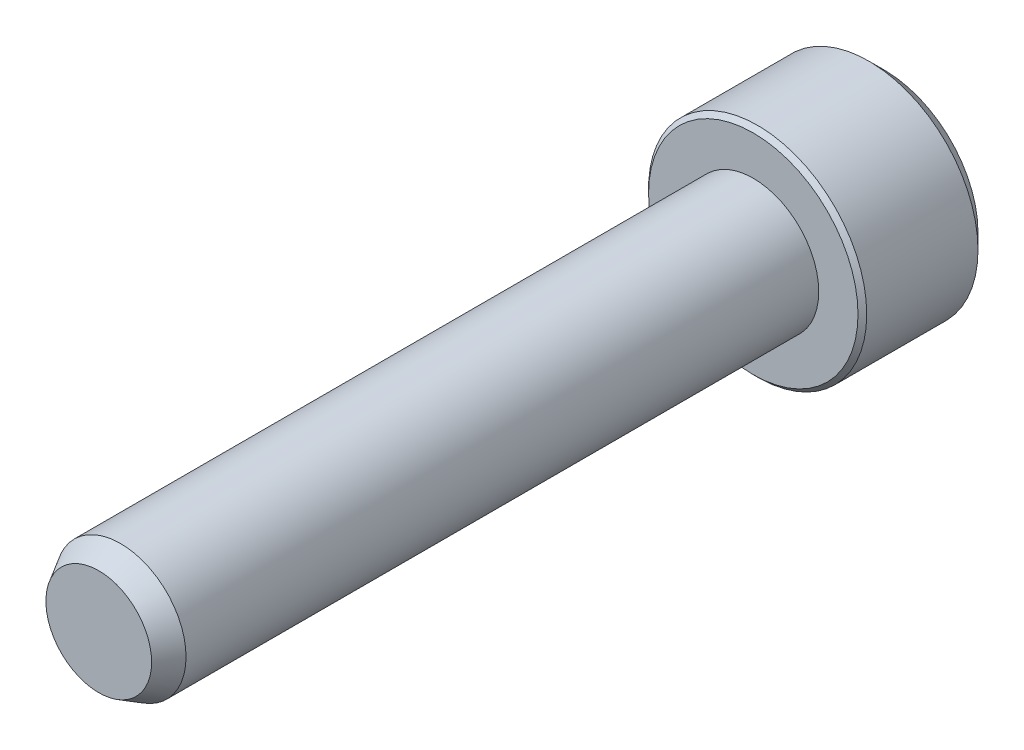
ISO-10303-21;
HEADER;
FILE_DESCRIPTION(('STEP AP214'),'2;1');
FILE_NAME('part.step','',(''),(''),'','','');
FILE_SCHEMA(('AUTOMOTIVE_DESIGN { 1 0 10303 214 1 1 1 1 }'));
ENDSEC;
DATA;
#1=APPLICATION_CONTEXT('core data for automotive mechanical design processes');
#2=APPLICATION_PROTOCOL_DEFINITION('international standard','automotive_design',2000,#1);
#3=PRODUCT_CONTEXT('',#1,'mechanical');
#4=PRODUCT('Part','Part','',(#3));
#5=PRODUCT_RELATED_PRODUCT_CATEGORY('part','',(#4));
#6=PRODUCT_DEFINITION_FORMATION('','',#4);
#7=PRODUCT_DEFINITION_CONTEXT('part definition',#1,'design');
#8=PRODUCT_DEFINITION('design','',#6,#7);
#9=PRODUCT_DEFINITION_SHAPE('','',#8);
#10=(LENGTH_UNIT() NAMED_UNIT(*) SI_UNIT(.MILLI.,.METRE.));
#11=(NAMED_UNIT(*) PLANE_ANGLE_UNIT() SI_UNIT($,.RADIAN.));
#12=(NAMED_UNIT(*) SI_UNIT($,.STERADIAN.) SOLID_ANGLE_UNIT());
#13=UNCERTAINTY_MEASURE_WITH_UNIT(LENGTH_MEASURE(1.E-05),#10,'distance_accuracy_value','');
#14=(GEOMETRIC_REPRESENTATION_CONTEXT(3) GLOBAL_UNCERTAINTY_ASSIGNED_CONTEXT((#13)) GLOBAL_UNIT_ASSIGNED_CONTEXT((#10,
#11,#12)) REPRESENTATION_CONTEXT('',''));
#15=CARTESIAN_POINT('',(0.,0.,0.));
#16=DIRECTION('',(0.,0.,1.));
#17=DIRECTION('',(1.,0.,0.));
#18=AXIS2_PLACEMENT_3D('',#15,#16,#17);
#19=CARTESIAN_POINT('',(0.,3.33066907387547E-13,-6.));
#20=DIRECTION('',(0.,0.,1.));
#21=DIRECTION('',(0.999999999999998,0.,0.));
#22=AXIS2_PLACEMENT_3D('',#19,#20,#21);
#23=PLANE('',#22);
#24=CARTESIAN_POINT('',(0.,3.33066907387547E-13,-6.));
#25=DIRECTION('',(0.,0.,1.));
#26=DIRECTION('',(0.999999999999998,0.,0.));
#27=AXIS2_PLACEMENT_3D('',#24,#25,#26);
#28=CIRCLE('',#27,4.3);
#29=CARTESIAN_POINT('',(4.3,3.33365279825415E-13,-6.));
#30=VERTEX_POINT('',#29);
#31=EDGE_CURVE('E139',#30,#30,#28,.F.);
#32=ORIENTED_EDGE('',*,*,#31,.T.);
#33=EDGE_LOOP('',(#32));
#34=FACE_BOUND('',#33,.T.);
#35=DIRECTION('',(-0.500000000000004,-0.866025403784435,0.));
#36=VECTOR('',#35,1.);
#37=CARTESIAN_POINT('',(-1.44337567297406,2.50000000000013,-6.));
#38=LINE('',#37,#36);
#39=CARTESIAN_POINT('',(-1.44337567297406,2.50000000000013,-6.));
#40=VERTEX_POINT('',#39);
#41=CARTESIAN_POINT('',(-2.88675134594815,1.11022302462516E-13,-6.00000000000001));
#42=VERTEX_POINT('',#41);
#43=EDGE_CURVE('E46',#40,#42,#38,.T.);
#44=ORIENTED_EDGE('',*,*,#43,.T.);
#45=DIRECTION('',(0.500000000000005,-0.866025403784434,0.));
#46=VECTOR('',#45,1.);
#47=CARTESIAN_POINT('',(-2.88675134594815,1.11022302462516E-13,-6.00000000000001));
#48=LINE('',#47,#46);
#49=CARTESIAN_POINT('',(-1.4433756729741,-2.50000000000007,-6.00000000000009));
#50=VERTEX_POINT('',#49);
#51=EDGE_CURVE('E86',#42,#50,#48,.T.);
#52=ORIENTED_EDGE('',*,*,#51,.T.);
#53=DIRECTION('',(0.999999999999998,0.,0.));
#54=VECTOR('',#53,1.);
#55=CARTESIAN_POINT('',(-1.4433756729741,-2.50000000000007,-6.00000000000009));
#56=LINE('',#55,#54);
#57=CARTESIAN_POINT('',(1.44337567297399,-2.49999999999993,-6.00000000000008));
#58=VERTEX_POINT('',#57);
#59=EDGE_CURVE('E94',#50,#58,#56,.T.);
#60=ORIENTED_EDGE('',*,*,#59,.T.);
#61=DIRECTION('',(0.500000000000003,0.866025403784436,0.));
#62=VECTOR('',#61,1.);
#63=CARTESIAN_POINT('',(1.44337567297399,-2.49999999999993,-6.00000000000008));
#64=LINE('',#63,#62);
#65=CARTESIAN_POINT('',(2.88675134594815,0.,-6.));
#66=VERTEX_POINT('',#65);
#67=EDGE_CURVE('E109',#58,#66,#64,.T.);
#68=ORIENTED_EDGE('',*,*,#67,.T.);
#69=DIRECTION('',(-0.499999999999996,0.866025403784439,0.));
#70=VECTOR('',#69,1.);
#71=CARTESIAN_POINT('',(1.443375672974,2.50000000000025,-6.));
#72=LINE('',#71,#70);
#73=CARTESIAN_POINT('',(1.443375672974,2.50000000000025,-6.));
#74=VERTEX_POINT('',#73);
#75=EDGE_CURVE('E112',#66,#74,#72,.T.);
#76=ORIENTED_EDGE('',*,*,#75,.T.);
#77=DIRECTION('',(-0.999999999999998,0.,0.));
#78=VECTOR('',#77,1.);
#79=CARTESIAN_POINT('',(-1.44337567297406,2.50000000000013,-6.));
#80=LINE('',#79,#78);
#81=EDGE_CURVE('E105',#74,#40,#80,.T.);
#82=ORIENTED_EDGE('',*,*,#81,.T.);
#83=EDGE_LOOP('',(#44,#52,#60,#68,#76,#82));
#84=FACE_BOUND('',#83,.T.);
#85=ADVANCED_FACE('F31',(#34,#84),#23,.F.);
#86=CARTESIAN_POINT('',(0.,0.,29.9999999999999));
#87=DIRECTION('',(0.,0.,-1.));
#88=DIRECTION('',(-0.999999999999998,0.,0.));
#89=AXIS2_PLACEMENT_3D('',#86,#87,#88);
#90=CYLINDRICAL_SURFACE('',#89,3.);
#91=CARTESIAN_POINT('',(0.,0.,28.9999999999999));
#92=DIRECTION('',(0.,0.,1.));
#93=DIRECTION('',(0.999999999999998,0.,0.));
#94=AXIS2_PLACEMENT_3D('',#91,#92,#93);
#95=CIRCLE('',#94,3.);
#96=CARTESIAN_POINT('',(2.99999999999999,0.,28.9999999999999));
#97=VERTEX_POINT('',#96);
#98=EDGE_CURVE('E145',#97,#97,#95,.F.);
#99=ORIENTED_EDGE('',*,*,#98,.T.);
#100=EDGE_LOOP('',(#99));
#101=FACE_BOUND('',#100,.T.);
#102=CARTESIAN_POINT('',(0.,0.,0.));
#103=DIRECTION('',(0.,0.,1.));
#104=DIRECTION('',(0.999999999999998,0.,0.));
#105=AXIS2_PLACEMENT_3D('',#102,#103,#104);
#106=CIRCLE('',#105,3.);
#107=CARTESIAN_POINT('',(2.99999999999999,0.,0.));
#108=VERTEX_POINT('',#107);
#109=EDGE_CURVE('E100',#108,#108,#106,.T.);
#110=ORIENTED_EDGE('',*,*,#109,.T.);
#111=EDGE_LOOP('',(#110));
#112=FACE_BOUND('',#111,.T.);
#113=ADVANCED_FACE('F33',(#101,#112),#90,.T.);
#114=CARTESIAN_POINT('',(0.,0.,29.9999999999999));
#115=DIRECTION('',(0.,0.,1.));
#116=DIRECTION('',(0.999999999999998,0.,0.));
#117=AXIS2_PLACEMENT_3D('',#114,#115,#116);
#118=PLANE('',#117);
#119=CARTESIAN_POINT('',(0.,0.,29.9999999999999));
#120=DIRECTION('',(0.,0.,1.));
#121=DIRECTION('',(0.999999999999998,0.,0.));
#122=AXIS2_PLACEMENT_3D('',#119,#120,#121);
#123=CIRCLE('',#122,2.42264973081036);
#124=CARTESIAN_POINT('',(2.42264973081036,0.,29.9999999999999));
#125=VERTEX_POINT('',#124);
#126=EDGE_CURVE('E142',#125,#125,#123,.T.);
#127=ORIENTED_EDGE('',*,*,#126,.T.);
#128=EDGE_LOOP('',(#127));
#129=FACE_BOUND('',#128,.T.);
#130=ADVANCED_FACE('F171',(#129),#118,.T.);
#131=CARTESIAN_POINT('',(0.,0.,0.));
#132=DIRECTION('',(0.,0.,1.));
#133=DIRECTION('',(0.999999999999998,0.,0.));
#134=AXIS2_PLACEMENT_3D('',#131,#132,#133);
#135=PLANE('',#134);
#136=CARTESIAN_POINT('',(0.,0.,0.));
#137=DIRECTION('',(0.,0.,1.));
#138=DIRECTION('',(0.999999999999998,0.,0.));
#139=AXIS2_PLACEMENT_3D('',#136,#137,#138);
#140=CIRCLE('',#139,4.8);
#141=CARTESIAN_POINT('',(4.79999999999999,0.,0.));
#142=VERTEX_POINT('',#141);
#143=EDGE_CURVE('E39',#142,#142,#140,.T.);
#144=ORIENTED_EDGE('',*,*,#143,.T.);
#145=EDGE_LOOP('',(#144));
#146=FACE_BOUND('',#145,.T.);
#147=ORIENTED_EDGE('',*,*,#109,.F.);
#148=EDGE_LOOP('',(#147));
#149=FACE_BOUND('',#148,.T.);
#150=ADVANCED_FACE('F150',(#146,#149),#135,.T.);
#151=CARTESIAN_POINT('',(0.,3.33066907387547E-13,-6.));
#152=DIRECTION('',(0.,0.,1.));
#153=DIRECTION('',(0.999999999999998,0.,0.));
#154=AXIS2_PLACEMENT_3D('',#151,#152,#153);
#155=CYLINDRICAL_SURFACE('',#154,5.);
#156=CARTESIAN_POINT('',(0.,0.,-0.199999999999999));
#157=DIRECTION('',(0.,0.,1.));
#158=DIRECTION('',(0.999999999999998,0.,0.));
#159=AXIS2_PLACEMENT_3D('',#156,#157,#158);
#160=CIRCLE('',#159,5.);
#161=CARTESIAN_POINT('',(5.,0.,-0.199999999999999));
#162=VERTEX_POINT('',#161);
#163=EDGE_CURVE('E11',#162,#162,#160,.F.);
#164=ORIENTED_EDGE('',*,*,#163,.T.);
#165=EDGE_LOOP('',(#164));
#166=FACE_BOUND('',#165,.T.);
#167=CARTESIAN_POINT('',(0.,2.63677968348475E-13,-5.3));
#168=DIRECTION('',(0.,0.,1.));
#169=DIRECTION('',(0.999999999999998,0.,0.));
#170=AXIS2_PLACEMENT_3D('',#167,#168,#169);
#171=CIRCLE('',#170,5.);
#172=CARTESIAN_POINT('',(5.00000000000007,2.6402491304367E-13,-5.3));
#173=VERTEX_POINT('',#172);
#174=EDGE_CURVE('E136',#173,#173,#171,.T.);
#175=ORIENTED_EDGE('',*,*,#174,.T.);
#176=EDGE_LOOP('',(#175));
#177=FACE_BOUND('',#176,.T.);
#178=ADVANCED_FACE('F176',(#166,#177),#155,.T.);
#179=CARTESIAN_POINT('',(-1.44337567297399,2.50000000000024,-3.));
#180=DIRECTION('',(0.866025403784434,-0.500000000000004,0.));
#181=DIRECTION('',(0.500000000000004,0.866025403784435,0.));
#182=AXIS2_PLACEMENT_3D('',#179,#180,#181);
#183=PLANE('',#182);
#184=ORIENTED_EDGE('',*,*,#43,.F.);
#185=DIRECTION('',(0.,0.,-1.));
#186=VECTOR('',#185,1.);
#187=CARTESIAN_POINT('',(-1.44337567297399,2.50000000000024,-3.));
#188=LINE('',#187,#186);
#189=CARTESIAN_POINT('',(-1.44337567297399,2.50000000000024,-3.));
#190=VERTEX_POINT('',#189);
#191=EDGE_CURVE('E125',#190,#40,#188,.T.);
#192=ORIENTED_EDGE('',*,*,#191,.F.);
#193=DIRECTION('',(-0.500000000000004,-0.866025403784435,0.));
#194=VECTOR('',#193,1.);
#195=CARTESIAN_POINT('',(-1.44337567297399,2.50000000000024,-3.));
#196=LINE('',#195,#194);
#197=CARTESIAN_POINT('',(-2.88675134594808,3.05311331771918E-13,-3.00000000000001));
#198=VERTEX_POINT('',#197);
#199=EDGE_CURVE('E99',#190,#198,#196,.T.);
#200=ORIENTED_EDGE('',*,*,#199,.T.);
#201=DIRECTION('',(0.,0.,-1.));
#202=VECTOR('',#201,1.);
#203=CARTESIAN_POINT('',(-2.88675134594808,3.05311331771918E-13,-3.00000000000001));
#204=LINE('',#203,#202);
#205=EDGE_CURVE('E88',#198,#42,#204,.T.);
#206=ORIENTED_EDGE('',*,*,#205,.T.);
#207=EDGE_LOOP('',(#184,#192,#200,#206));
#208=FACE_BOUND('',#207,.T.);
#209=ADVANCED_FACE('F97',(#208),#183,.T.);
#210=CARTESIAN_POINT('',(-2.88675134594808,3.05311331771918E-13,-3.00000000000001));
#211=DIRECTION('',(0.866025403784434,0.500000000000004,0.));
#212=DIRECTION('',(-0.500000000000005,0.866025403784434,0.));
#213=AXIS2_PLACEMENT_3D('',#210,#211,#212);
#214=PLANE('',#213);
#215=ORIENTED_EDGE('',*,*,#51,.F.);
#216=ORIENTED_EDGE('',*,*,#205,.F.);
#217=DIRECTION('',(0.500000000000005,-0.866025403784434,0.));
#218=VECTOR('',#217,1.);
#219=CARTESIAN_POINT('',(-2.88675134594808,3.05311331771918E-13,-3.00000000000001));
#220=LINE('',#219,#218);
#221=CARTESIAN_POINT('',(-1.44337567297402,-2.50000000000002,-3.00000000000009));
#222=VERTEX_POINT('',#221);
#223=EDGE_CURVE('E116',#198,#222,#220,.T.);
#224=ORIENTED_EDGE('',*,*,#223,.T.);
#225=DIRECTION('',(0.,0.,-1.));
#226=VECTOR('',#225,1.);
#227=CARTESIAN_POINT('',(-1.44337567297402,-2.50000000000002,-3.00000000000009));
#228=LINE('',#227,#226);
#229=EDGE_CURVE('E90',#222,#50,#228,.T.);
#230=ORIENTED_EDGE('',*,*,#229,.T.);
#231=EDGE_LOOP('',(#215,#216,#224,#230));
#232=FACE_BOUND('',#231,.T.);
#233=ADVANCED_FACE('F87',(#232),#214,.T.);
#234=CARTESIAN_POINT('',(-1.44337567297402,-2.50000000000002,-3.00000000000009));
#235=DIRECTION('',(0.,0.999999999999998,0.));
#236=DIRECTION('',(0.,0.,1.));
#237=AXIS2_PLACEMENT_3D('',#234,#235,#236);
#238=PLANE('',#237);
#239=ORIENTED_EDGE('',*,*,#59,.F.);
#240=ORIENTED_EDGE('',*,*,#229,.F.);
#241=DIRECTION('',(0.999999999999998,0.,0.));
#242=VECTOR('',#241,1.);
#243=CARTESIAN_POINT('',(-1.44337567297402,-2.50000000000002,-3.00000000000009));
#244=LINE('',#243,#242);
#245=CARTESIAN_POINT('',(1.44337567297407,-2.50000000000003,-3.00000000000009));
#246=VERTEX_POINT('',#245);
#247=EDGE_CURVE('E118',#222,#246,#244,.T.);
#248=ORIENTED_EDGE('',*,*,#247,.T.);
#249=DIRECTION('',(0.,0.,-1.));
#250=VECTOR('',#249,1.);
#251=CARTESIAN_POINT('',(1.44337567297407,-2.50000000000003,-3.00000000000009));
#252=LINE('',#251,#250);
#253=EDGE_CURVE('E131',#246,#58,#252,.T.);
#254=ORIENTED_EDGE('',*,*,#253,.T.);
#255=EDGE_LOOP('',(#239,#240,#248,#254));
#256=FACE_BOUND('',#255,.T.);
#257=ADVANCED_FACE('F203',(#256),#238,.T.);
#258=CARTESIAN_POINT('',(1.44337567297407,-2.50000000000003,-3.00000000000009));
#259=DIRECTION('',(-0.866025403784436,0.500000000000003,0.));
#260=DIRECTION('',(-0.500000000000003,-0.866025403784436,0.));
#261=AXIS2_PLACEMENT_3D('',#258,#259,#260);
#262=PLANE('',#261);
#263=ORIENTED_EDGE('',*,*,#67,.F.);
#264=ORIENTED_EDGE('',*,*,#253,.F.);
#265=DIRECTION('',(0.500000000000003,0.866025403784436,0.));
#266=VECTOR('',#265,1.);
#267=CARTESIAN_POINT('',(1.44337567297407,-2.50000000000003,-3.00000000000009));
#268=LINE('',#267,#266);
#269=CARTESIAN_POINT('',(2.88675134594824,1.11022302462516E-13,-3.));
#270=VERTEX_POINT('',#269);
#271=EDGE_CURVE('E120',#246,#270,#268,.T.);
#272=ORIENTED_EDGE('',*,*,#271,.T.);
#273=DIRECTION('',(0.,0.,-1.));
#274=VECTOR('',#273,1.);
#275=CARTESIAN_POINT('',(2.88675134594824,1.11022302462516E-13,-3.));
#276=LINE('',#275,#274);
#277=EDGE_CURVE('E129',#270,#66,#276,.T.);
#278=ORIENTED_EDGE('',*,*,#277,.T.);
#279=EDGE_LOOP('',(#263,#264,#272,#278));
#280=FACE_BOUND('',#279,.T.);
#281=ADVANCED_FACE('F210',(#280),#262,.T.);
#282=CARTESIAN_POINT('',(1.44337567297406,2.50000000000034,-3.));
#283=DIRECTION('',(-0.866025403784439,-0.499999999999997,0.));
#284=DIRECTION('',(0.499999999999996,-0.866025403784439,0.));
#285=AXIS2_PLACEMENT_3D('',#282,#283,#284);
#286=PLANE('',#285);
#287=ORIENTED_EDGE('',*,*,#75,.F.);
#288=ORIENTED_EDGE('',*,*,#277,.F.);
#289=DIRECTION('',(-0.499999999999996,0.866025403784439,0.));
#290=VECTOR('',#289,1.);
#291=CARTESIAN_POINT('',(1.44337567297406,2.50000000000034,-3.));
#292=LINE('',#291,#290);
#293=CARTESIAN_POINT('',(1.44337567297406,2.50000000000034,-3.));
#294=VERTEX_POINT('',#293);
#295=EDGE_CURVE('E122',#270,#294,#292,.T.);
#296=ORIENTED_EDGE('',*,*,#295,.T.);
#297=DIRECTION('',(0.,0.,-1.));
#298=VECTOR('',#297,1.);
#299=CARTESIAN_POINT('',(1.44337567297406,2.50000000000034,-3.));
#300=LINE('',#299,#298);
#301=EDGE_CURVE('E127',#294,#74,#300,.T.);
#302=ORIENTED_EDGE('',*,*,#301,.T.);
#303=EDGE_LOOP('',(#287,#288,#296,#302));
#304=FACE_BOUND('',#303,.T.);
#305=ADVANCED_FACE('F218',(#304),#286,.T.);
#306=CARTESIAN_POINT('',(-1.44337567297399,2.50000000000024,-3.));
#307=DIRECTION('',(0.,-0.999999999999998,0.));
#308=DIRECTION('',(0.,0.,-1.));
#309=AXIS2_PLACEMENT_3D('',#306,#307,#308);
#310=PLANE('',#309);
#311=ORIENTED_EDGE('',*,*,#81,.F.);
#312=ORIENTED_EDGE('',*,*,#301,.F.);
#313=DIRECTION('',(-0.999999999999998,0.,0.));
#314=VECTOR('',#313,1.);
#315=CARTESIAN_POINT('',(-1.44337567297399,2.50000000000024,-3.));
#316=LINE('',#315,#314);
#317=EDGE_CURVE('E53',#294,#190,#316,.T.);
#318=ORIENTED_EDGE('',*,*,#317,.T.);
#319=ORIENTED_EDGE('',*,*,#191,.T.);
#320=EDGE_LOOP('',(#311,#312,#318,#319));
#321=FACE_BOUND('',#320,.T.);
#322=ADVANCED_FACE('F226',(#321),#310,.T.);
#323=CARTESIAN_POINT('',(-2.88675134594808,3.05311331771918E-13,-3.00000000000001));
#324=DIRECTION('',(0.,0.,1.));
#325=DIRECTION('',(0.999999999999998,0.,0.));
#326=AXIS2_PLACEMENT_3D('',#323,#324,#325);
#327=PLANE('',#326);
#328=ORIENTED_EDGE('',*,*,#199,.F.);
#329=ORIENTED_EDGE('',*,*,#317,.F.);
#330=ORIENTED_EDGE('',*,*,#295,.F.);
#331=ORIENTED_EDGE('',*,*,#271,.F.);
#332=ORIENTED_EDGE('',*,*,#247,.F.);
#333=ORIENTED_EDGE('',*,*,#223,.F.);
#334=EDGE_LOOP('',(#328,#329,#330,#331,#332,#333));
#335=FACE_BOUND('',#334,.T.);
#336=ADVANCED_FACE('F234',(#335),#327,.F.);
#337=CARTESIAN_POINT('',(0.,2.63677968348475E-13,-5.3));
#338=DIRECTION('',(0.,0.,1.));
#339=DIRECTION('',(0.999999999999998,0.,0.));
#340=AXIS2_PLACEMENT_3D('',#337,#338,#339);
#341=CONICAL_SURFACE('',#340,5.,0.78539816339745);
#342=ORIENTED_EDGE('',*,*,#31,.F.);
#343=EDGE_LOOP('',(#342));
#344=FACE_BOUND('',#343,.T.);
#345=ORIENTED_EDGE('',*,*,#174,.F.);
#346=EDGE_LOOP('',(#345));
#347=FACE_BOUND('',#346,.T.);
#348=ADVANCED_FACE('F161',(#344,#347),#341,.T.);
#349=CARTESIAN_POINT('',(0.,0.,29.9999999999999));
#350=DIRECTION('',(0.,0.,-1.));
#351=DIRECTION('',(-0.999999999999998,0.,0.));
#352=AXIS2_PLACEMENT_3D('',#349,#350,#351);
#353=CONICAL_SURFACE('',#352,2.42264973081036,0.523598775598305);
#354=ORIENTED_EDGE('',*,*,#98,.F.);
#355=EDGE_LOOP('',(#354));
#356=FACE_BOUND('',#355,.T.);
#357=ORIENTED_EDGE('',*,*,#126,.F.);
#358=EDGE_LOOP('',(#357));
#359=FACE_BOUND('',#358,.T.);
#360=ADVANCED_FACE('F155',(#356,#359),#353,.T.);
#361=CARTESIAN_POINT('',(0.,0.,0.));
#362=DIRECTION('',(0.,0.,-1.));
#363=DIRECTION('',(-0.999999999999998,0.,0.));
#364=AXIS2_PLACEMENT_3D('',#361,#362,#363);
#365=CONICAL_SURFACE('',#364,4.8,0.785398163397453);
#366=ORIENTED_EDGE('',*,*,#163,.F.);
#367=EDGE_LOOP('',(#366));
#368=FACE_BOUND('',#367,.T.);
#369=ORIENTED_EDGE('',*,*,#143,.F.);
#370=EDGE_LOOP('',(#369));
#371=FACE_BOUND('',#370,.T.);
#372=ADVANCED_FACE('F153',(#368,#371),#365,.T.);
#373=CLOSED_SHELL('',(#85,#113,#130,#150,#178,#209,#233,#257,#281,#305,#322,#336,#348,#360,#372));
#374=MANIFOLD_SOLID_BREP('B2',#373);
#375=ADVANCED_BREP_SHAPE_REPRESENTATION('',(#18,#374),#14);
#376=SHAPE_DEFINITION_REPRESENTATION(#9,#375);
ENDSEC;
END-ISO-10303-21;
